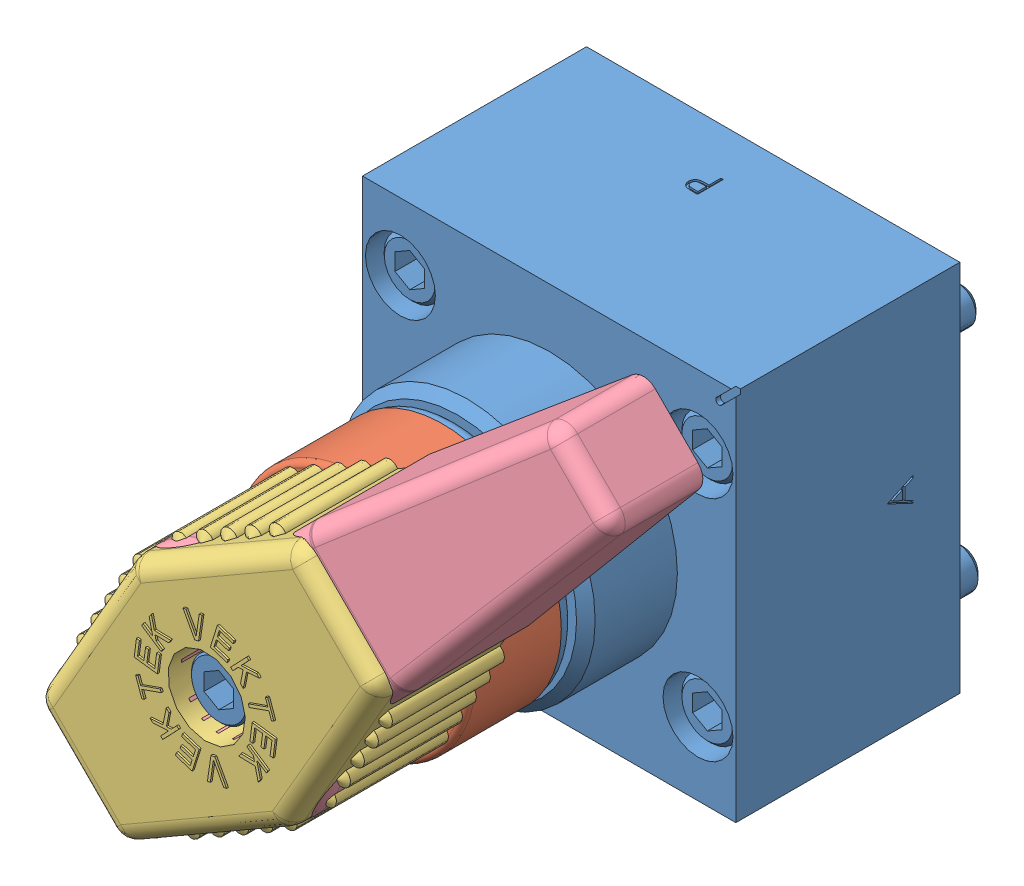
SolidWorks assembly ILCMV47114221.SLDASM, configuration Default (file format 5000). Lengths in mm.
Overall size (58.16 58.16 83.25).
4 component instances, 4 part files, 9 mates.
Components (placement in the parent):
- ILCMV47114221_BASE-1: ILCMV47114221_BASE.sldprt [Default] at (-15.8323 -18.8061 -17.6471) size (50.8 50.8 81.03)
- ILCMV47114221_ADAPTER-1: ILCMV47114221_ADAPTER.sldprt [Default] at (-41.2323 6.5939 48.5199) x (0 0 -1) z (1 0 0) size (22.23 32.26 32.26)
- 85600903-1: 85600903.sldprt [Default] at (-41.2323 6.5939 59.4419) x (0.707107 0.707107 0) z (0.707107 -0.707107 0) size (51.61 19.62 30.64)
- 85600902-1: 85600902.SLDPRT [Default] at (-41.2323 6.5939 40.3919) x (0 0 1) z (0.707107 -0.707107 0) size (17.76 89.76 30.23) (hidden)
Mates (geometry in assembly coordinates):
- Concentric1: concentric aligned: cylinder of ILCMV47114221_BASE-1 through (-41.2323 6.5939 42.7223) axis (0 0 1) radius 3.9624; cylinder of ILCMV47114221_ADAPTER-1 through (-41.2323 6.5939 20.2153) axis (0 0 1) radius 6.35
- Coincident1: coincident anti-aligned: plane of ILCMV47114221_BASE-1 through (-41.2323 6.5939 26.2949) normal (0 0 1); plane of ILCMV47114221_ADAPTER-1 through (-41.2323 6.5939 26.2949) normal (0 0 -1)
- Parallel1: parallel: line of ILCMV47114221_BASE-1 through (-15.8323 31.3589 12.8329) axis (-0.707107 -0.707107 0); plane of ILCMV47114221_ADAPTER-1 through (-52.2305 11.1495 48.5199) normal (-0.707107 0.707107 0)
- Concentric2: concentric aligned: cylinder of ILCMV47114221_BASE-1 through (-41.2323 6.5939 42.7223) axis (0 0 1) radius 3.9624; cylinder of 85600903-1 through (-41.2323 6.5939 31.1453) axis (0 0 1) radius 5.2705
- Parallel2: parallel anti-aligned: plane of ILCMV47114221_ADAPTER-1 through (-52.2305 11.1495 48.5199) normal (-0.707107 0.707107 0); plane of 85600903-1 through (-52.4083 11.2231 40.3919) normal (0.707107 -0.707107 0)
- Coincident4: coincident anti-aligned: plane of ILCMV47114221_ADAPTER-1 through (-41.2323 6.5939 48.5199) normal (0 0 1); plane of 85600903-1 through (-41.2323 6.5939 48.5199) normal (0 0 -1)
- Concentric3: concentric aligned: cylinder of ILCMV47114221_BASE-1 through (-41.2323 6.5939 42.7223) axis (0 0 1) radius 3.9624; cylinder of 85600902-1 through (-41.2323 6.5939 44.3289) axis (0 0 1) radius 5.2705
- Parallel3: parallel anti-aligned: plane of ILCMV47114221_ADAPTER-1 through (-52.2305 11.1495 48.5199) normal (-0.707107 0.707107 0); plane of 85600902-1 through (-52.4083 11.2231 40.3919) normal (0.707107 -0.707107 0)
- Coincident6: coincident anti-aligned: plane of ILCMV47114221_ADAPTER-1 through (-41.2323 6.5939 48.5199) normal (0 0 1); plane of 85600902-1 through (-41.2323 6.5939 48.5199) normal (0 0 -1)
